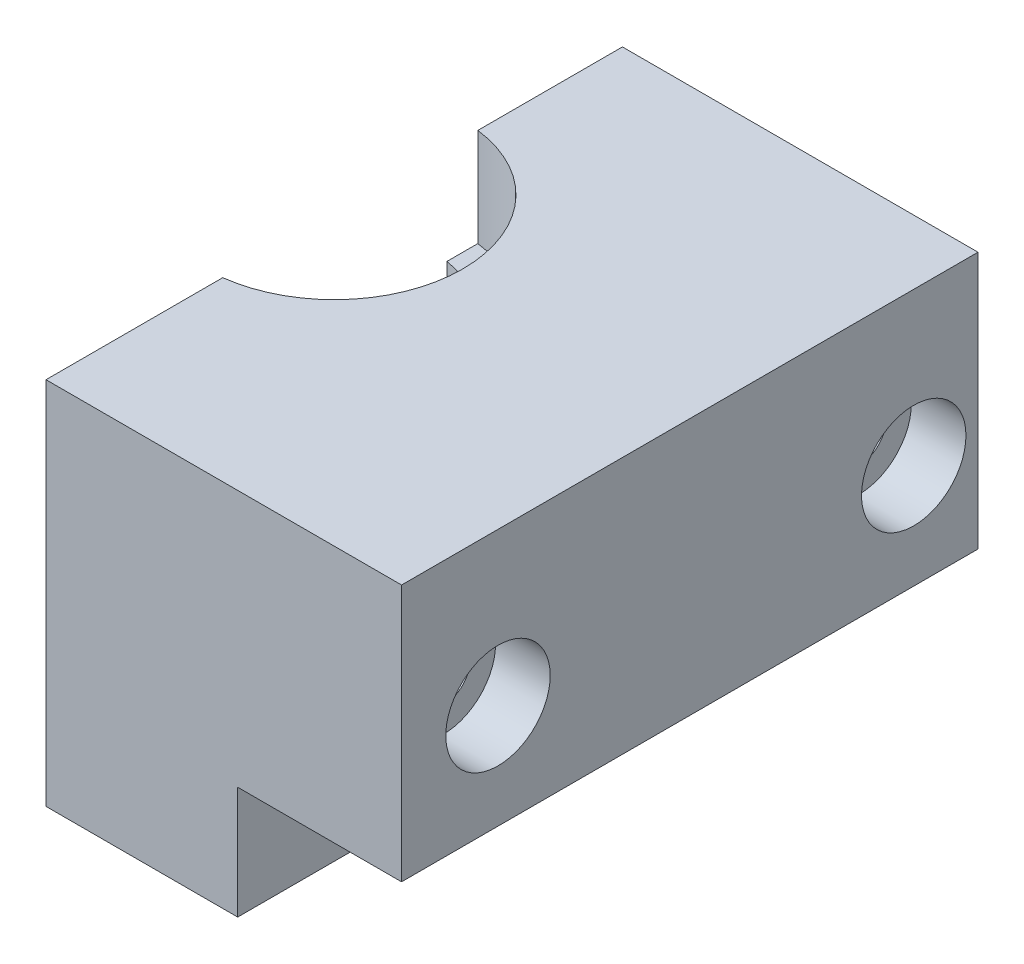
from build123d import *

# Parameters (mm, degrees)
SKIZZE1_W                                            = 35.875
SKIZZE1_H                                            = 23
AUFSATZ_LINEAR_AUSTRAGEN1_DEPTH                      = 11.065
SKIZZE2_R                                            = 8
SCHNITT_LINEAR_AUSTRAGEN1_DEPTH                      = 32.195963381
AUFSATZ_LINEAR_START                                 = -5.7
AUFSATZ_LINEAR_AUSTRAGEN2_DEPTH                      = 5.7
SKIZZE12_W                                           = 35.875
SKIZZE12_H                                           = 7
SCHNITT_LINEAR_AUSTRAGEN5_DEPTH                      = 25.419844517
F_4_0_4_DURCHMESSER_BOHRUNG1_D                       = 4
F_4_0_4_DURCHMESSER_BOHRUNG1_DEPTH                   = 7
SKIZZE17_W                                           = 1
SKIZZE17_H                                           = 23
SCHNITT_LINEAR_AUSTRAGEN7_DEPTH                      = 31.720364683
STIRNSENKUNG_F_R_M3_ZYLINDERSCHRAUBE_MIT_D           = 3.4
STIRNSENKUNG_F_R_M3_ZYLINDERSCHRAUBE_MIT_CBORE_D     = 6.5
STIRNSENKUNG_F_R_M3_ZYLINDERSCHRAUBE_MIT_CBORE_DEPTH = 3.4
SKIZZE16_R                                           = 12.5
SCHNITT_LINEAR_AUSTRAGEN6_DEPTH                      = 24.695016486
SKIZZE19_R                                           = 11.5
SCHNITT_LINEAR_AUSTRAGEN8_DEPTH                      = 4
AUFSATZ_LINEAR_AUSTRAGEN3_DEPTH                      = 2


with BuildPart() as part:
    # Skizze1 → Aufsatz-Linear austragen1 (new, symmetric)
    with BuildSketch(Plane(origin=(0, 0, 0), x_dir=(0, 0, -1), z_dir=(1, 0, 0))):
        Rectangle(SKIZZE1_W, SKIZZE1_H)
    extrude(amount=AUFSATZ_LINEAR_AUSTRAGEN1_DEPTH, both=True)

    # Skizze2 → Schnitt-Linear austragen1 (cut, through all)
    with BuildSketch(Plane(origin=(0, 11.5, 0), x_dir=(1, 0, 0), z_dir=(0, 1, 0))):
        with Locations((-12.065, 0)):
            Circle(SKIZZE2_R)
    extrude(amount=-SCHNITT_LINEAR_AUSTRAGEN1_DEPTH, mode=Mode.SUBTRACT)

    # Skizze5 → Aufsatz-Linear austragen2 (add)
    with BuildSketch(Plane(origin=(0, -0.3, 0), x_dir=(-1, 0, 0), z_dir=(0, -1, 0)).offset(AUFSATZ_LINEAR_START)):
        with BuildLine():
            Line((11.065, -7.937253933), (11.065, -6.017474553))
            ThreePointArc((11.065, -6.017474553), (5.965, 0), (11.065, 6.017474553))
            Line((11.065, 6.017474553), (11.065, 7.937253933))
            ThreePointArc((11.065, 7.937253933), (4.065, 0), (11.065, -7.937253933))
        make_face()
    extrude(amount=AUFSATZ_LINEAR_AUSTRAGEN2_DEPTH)

    # Skizze12 → Schnitt-Linear austragen5 (cut, through all)
    with BuildSketch(Plane(origin=(0.865, 0, 0), x_dir=(0, 0, -1), z_dir=(1, 0, 0))):
        with Locations((0, -8)):
            Rectangle(SKIZZE12_W, SKIZZE12_H)
    extrude(amount=SCHNITT_LINEAR_AUSTRAGEN5_DEPTH, mode=Mode.SUBTRACT)

    # 4.0 _4_ Durchmesser Bohrung1
    with Locations(Plane(origin=(0.865, 0, 0), x_dir=(0, 0, -1), z_dir=(1, 0, 0))):
        with Locations((-12, -7.5), (12, -7.5)):
            Hole(F_4_0_4_DURCHMESSER_BOHRUNG1_D / 2, depth=F_4_0_4_DURCHMESSER_BOHRUNG1_DEPTH)

    # Skizze17 → Schnitt-Linear austragen7 (cut, through all)
    with BuildSketch(Plane(origin=(11.065, 0, 0), x_dir=(0, 0, -1), z_dir=(1, 0, 0))):
        with Locations((-17.4375, 0)):
            Rectangle(SKIZZE17_W, SKIZZE17_H)
        with Locations((17.4375, 0)):
            Rectangle(SKIZZE17_W, SKIZZE17_H)
    extrude(amount=-SCHNITT_LINEAR_AUSTRAGEN7_DEPTH, mode=Mode.SUBTRACT)

    # Stirnsenkung f_r M3 Zylinderschraube mit (through all)
    with Locations(Plane(origin=(11.065, 0, 0), x_dir=(0, 0, -1), z_dir=(1, 0, 0))):
        with Locations((-12.9375, 2), (12.9375, 2)):
            CounterBoreHole(STIRNSENKUNG_F_R_M3_ZYLINDERSCHRAUBE_MIT_D / 2, STIRNSENKUNG_F_R_M3_ZYLINDERSCHRAUBE_MIT_CBORE_D / 2, STIRNSENKUNG_F_R_M3_ZYLINDERSCHRAUBE_MIT_CBORE_DEPTH)

    # Skizze16 → Schnitt-Linear austragen6 (cut, through all)
    with BuildSketch(Plane(origin=(0.865, 0, 0), x_dir=(0, 0, -1), z_dir=(1, 0, 0))):
        with Locations((0, -19.5)):
            Circle(SKIZZE16_R)
    extrude(amount=-SCHNITT_LINEAR_AUSTRAGEN6_DEPTH, mode=Mode.SUBTRACT)

    # Skizze19 → Schnitt-Linear austragen8 (cut)
    with BuildSketch(Plane.XZ.offset(11.5)):
        with Locations((-12.065, 0)):
            Circle(SKIZZE19_R)
    extrude(amount=-SCHNITT_LINEAR_AUSTRAGEN8_DEPTH, mode=Mode.SUBTRACT)

    # Skizze20 → Aufsatz-Linear austragen3 (add)
    with BuildSketch(Plane.XY.offset(16.9375)):
        Polygon((0.865, -4.5), (11.065, -4.5), (11.065, 11.5), (-11.065, 11.5), (-11.065, -11.5), (0.865, -11.5), align=None)
    extrude(amount=AUFSATZ_LINEAR_AUSTRAGEN3_DEPTH)


solid = part.part
